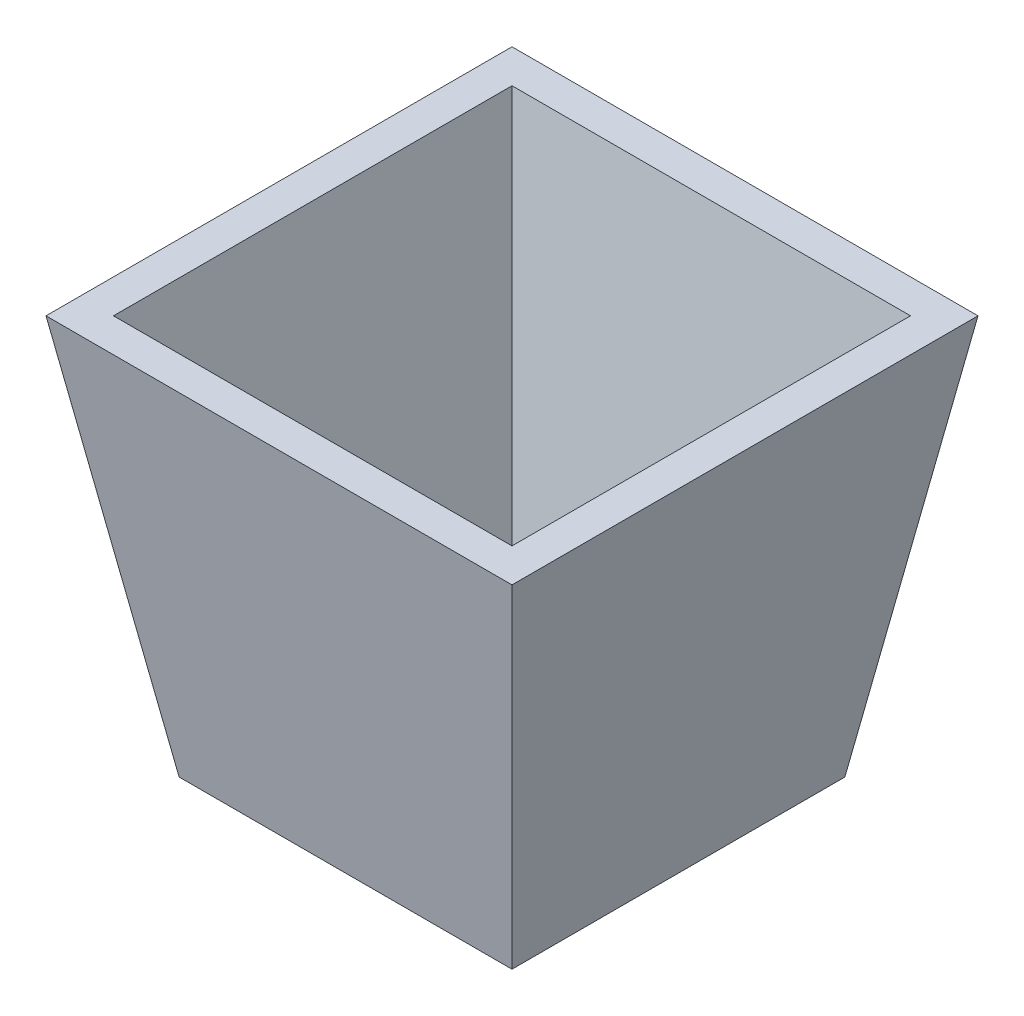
from build123d import *

# Parameters (mm, degrees)
SHELL1_T                = -10
CUT_EXTRUDE1_DEPTH      = 148.986486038
CUT_EXTRUDE1_DEPTH_BACK = 148.986486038
SKETCH3_W               = 83.057458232
SKETCH3_H               = 83.057458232


with BuildPart() as part:
    # Sketch2 → Loft1 section 0
    with BuildSketch(Plane(origin=(0, 120, 0), x_dir=(1, 0, 0), z_dir=(0, 1, 0))):
        with BuildLine():
            Line((-70, 70), (70, 70))
            Line((70, 70), (70, -70))
            Line((70, -70), (-70, -70))
            Line((-70, -70), (-70, 70))
        make_face()
    # Sketch1 → Loft1 section 1
    with BuildSketch(Plane(origin=(0, 0, 0), x_dir=(1, 0, 0), z_dir=(0, 1, 0))):
        with BuildLine():
            Line((-50, 50), (50, 50))
            Line((50, 50), (50, -50))
            Line((50, -50), (-50, -50))
            Line((-50, -50), (-50, 50))
        make_face()
    loft()

    # Shell1
    shell1_openings = [part.faces().sort_by_distance(p)[0] for p in [
        (0, 120, 0),
    ]]
    offset(amount=SHELL1_T, openings=shell1_openings, kind=Kind.INTERSECTION)

    # Sketch3 → Cut-Extrude1 (cut, two sides: drawn at the far end of the back side and taken through both)
    with BuildSketch(Plane(origin=(0, 10, 0), x_dir=(1, 0, 0), z_dir=(0, 1, 0)).offset(-CUT_EXTRUDE1_DEPTH_BACK)):
        Rectangle(SKETCH3_W, SKETCH3_H)
    extrude(amount=CUT_EXTRUDE1_DEPTH + CUT_EXTRUDE1_DEPTH_BACK, mode=Mode.SUBTRACT)


solid = part.part
